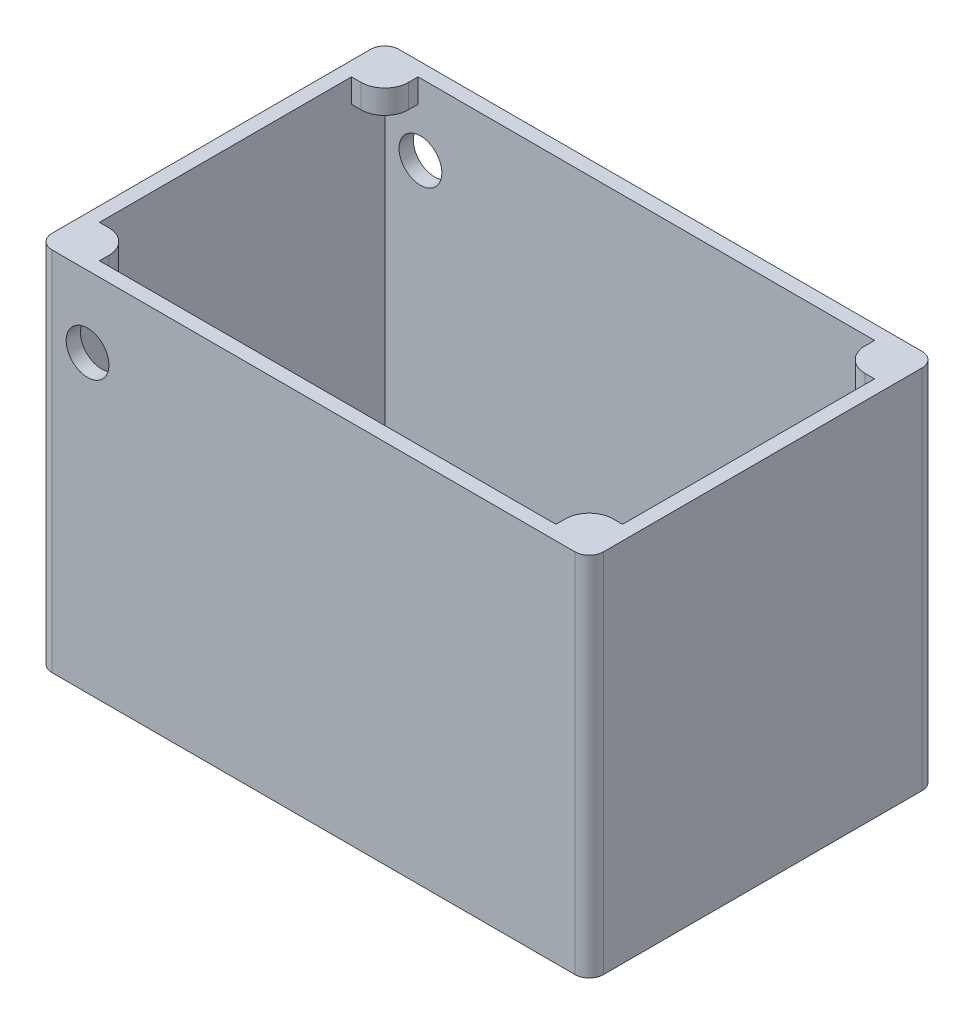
from build123d import *

# Parameters (mm, degrees)
SKETCH1_W               = 116
SKETCH1_H               = 73
BOSS_EXTRUDE1_DEPTH     = 77
SKETCH2_W               = 110
SKETCH2_H               = 67
CUT_EXTRUDE3_DEPTH      = 73.5
CUT_EXTRUDE6_DEPTH      = 120.13437791
CUT_EXTRUDE6_DEPTH_BACK = 120.13437791
SKETCH11_R              = 4.5
SKETCH12_W              = 10
SKETCH12_H              = 10
BOSS_EXTRUDE5_DEPTH     = 5
FILLET1_R               = 3
FILLET2_R               = 3
FILLET3_R               = 3
FILLET4_R               = 3
FILLET5_R               = 5
FILLET6_R               = 5
FILLET7_R               = 5
FILLET8_R               = 5


with BuildPart() as part:
    # Sketch1 → Boss-Extrude1 (new body)
    with BuildSketch(Plane(origin=(0, 0, 0), x_dir=(1, 0, 0), z_dir=(0, 1, 0))):
        Rectangle(SKETCH1_W, SKETCH1_H)
    extrude(amount=BOSS_EXTRUDE1_DEPTH)

    # Sketch2 → Cut-Extrude3 (cut)
    with BuildSketch(Plane(origin=(0, 77, 0), x_dir=(1, 0, 0), z_dir=(0, 1, 0))):
        Rectangle(SKETCH2_W, SKETCH2_H)
    extrude(amount=-CUT_EXTRUDE3_DEPTH, mode=Mode.SUBTRACT)

    # Sketch11 → Cut-Extrude6 (cut, two sides: drawn at the far end of the back side and taken through both)
    with BuildSketch(Plane(origin=(0, 0, 33.5), x_dir=(-1, 0, 0), z_dir=(0, 0, -1)).offset(-CUT_EXTRUDE6_DEPTH_BACK)):
        with Locations((47.5, 62)):
            Circle(SKETCH11_R)
    extrude(amount=CUT_EXTRUDE6_DEPTH + CUT_EXTRUDE6_DEPTH_BACK, mode=Mode.SUBTRACT)

    # Sketch12 → Boss-Extrude5 (add)
    with BuildSketch(Plane(origin=(0, 77, 0), x_dir=(1, 0, 0), z_dir=(0, 1, 0))):
        with Locations((53, 31.5)):
            Rectangle(SKETCH12_W, SKETCH12_H)
        with Locations((53, -31.5)):
            Rectangle(SKETCH12_W, SKETCH12_H)
        with Locations((-53, 31.5)):
            Rectangle(SKETCH12_W, SKETCH12_H)
        with Locations((-53, -31.5)):
            Rectangle(SKETCH12_W, SKETCH12_H)
    extrude(amount=-BOSS_EXTRUDE5_DEPTH)

    # Fillet1
    fillet1_edges = [part.edges().sort_by_distance(p)[0] for p in [
        (-58, 38.5, -36.5),
    ]]
    fillet(fillet1_edges, radius=FILLET1_R)

    # Fillet2
    fillet2_edges = [part.edges().sort_by_distance(p)[0] for p in [
        (-58, 38.5, 36.5),
    ]]
    fillet(fillet2_edges, radius=FILLET2_R)

    # Fillet3
    fillet3_edges = [part.edges().sort_by_distance(p)[0] for p in [
        (58, 38.5, 36.5),
    ]]
    fillet(fillet3_edges, radius=FILLET3_R)

    # Fillet4
    fillet4_edges = [part.edges().sort_by_distance(p)[0] for p in [
        (58, 38.5, -36.5),
    ]]
    fillet(fillet4_edges, radius=FILLET4_R)

    # Fillet5
    fillet5_edges = [part.edges().sort_by_distance(p)[0] for p in [
        (-48, 74.5, -26.5),
    ]]
    fillet(fillet5_edges, radius=FILLET5_R)

    # Fillet6
    fillet6_edges = [part.edges().sort_by_distance(p)[0] for p in [
        (-48, 74.5, 26.5),
    ]]
    fillet(fillet6_edges, radius=FILLET6_R)

    # Fillet7
    fillet7_edges = [part.edges().sort_by_distance(p)[0] for p in [
        (48, 74.5, -26.5),
    ]]
    fillet(fillet7_edges, radius=FILLET7_R)

    # Fillet8
    fillet8_edges = [part.edges().sort_by_distance(p)[0] for p in [
        (48, 74.5, 26.5),
    ]]
    fillet(fillet8_edges, radius=FILLET8_R)


solid = part.part
